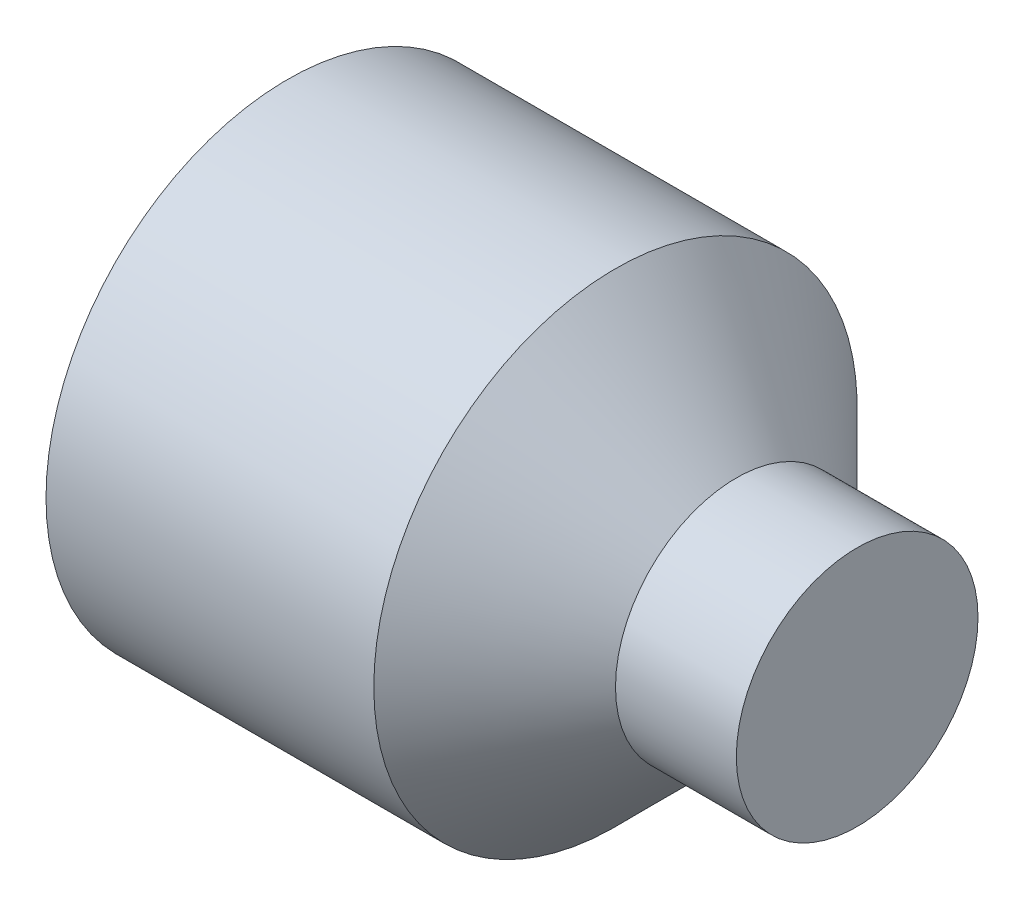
from build123d import *

# Parameters (mm, degrees)
HEXAGONSOCKET_DEPTH = 0.7


with BuildPart() as part:
    # BodySke → BaseBody (revolve)
    with BuildSketch(Plane.XY, mode=Mode.PRIVATE) as basebody_sk:
        Polygon((2, 0), (2, 0.4), (1.6, 0.4), (1.2, 0.8), (0, 0.8), (0, 0), align=None)
    revolve(basebody_sk.sketch.rotate(Axis((0, 0, 0), (1, 0, 0)), 90), axis=Axis((0, 0, 0), (1, 0, 0)))

    # HeadChamferSke → HeadChamfer (revolve, cut)
    with BuildSketch(Plane.XY, mode=Mode.PRIVATE) as headchamfer_sk:
        Polygon((0, 0.8), (0, 0.601), (0.114892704, 0.8), align=None)
    revolve(headchamfer_sk.sketch.rotate(Axis((0, 0, 0), (1, 0, 0)), 90), axis=Axis((0, 0, 0), (1, 0, 0)), mode=Mode.SUBTRACT)

    # HexagonSocketSke → HexagonSocket (cut)
    with BuildSketch(Plane.ZY):
        Polygon((0, 0.404145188), (-0.35, 0.202072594), (-0.35, -0.202072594), (0, -0.404145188), (0.35, -0.202072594), (0.35, 0.202072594), align=None)
    extrude(amount=-HEXAGONSOCKET_DEPTH, mode=Mode.SUBTRACT)


solid = part.part
